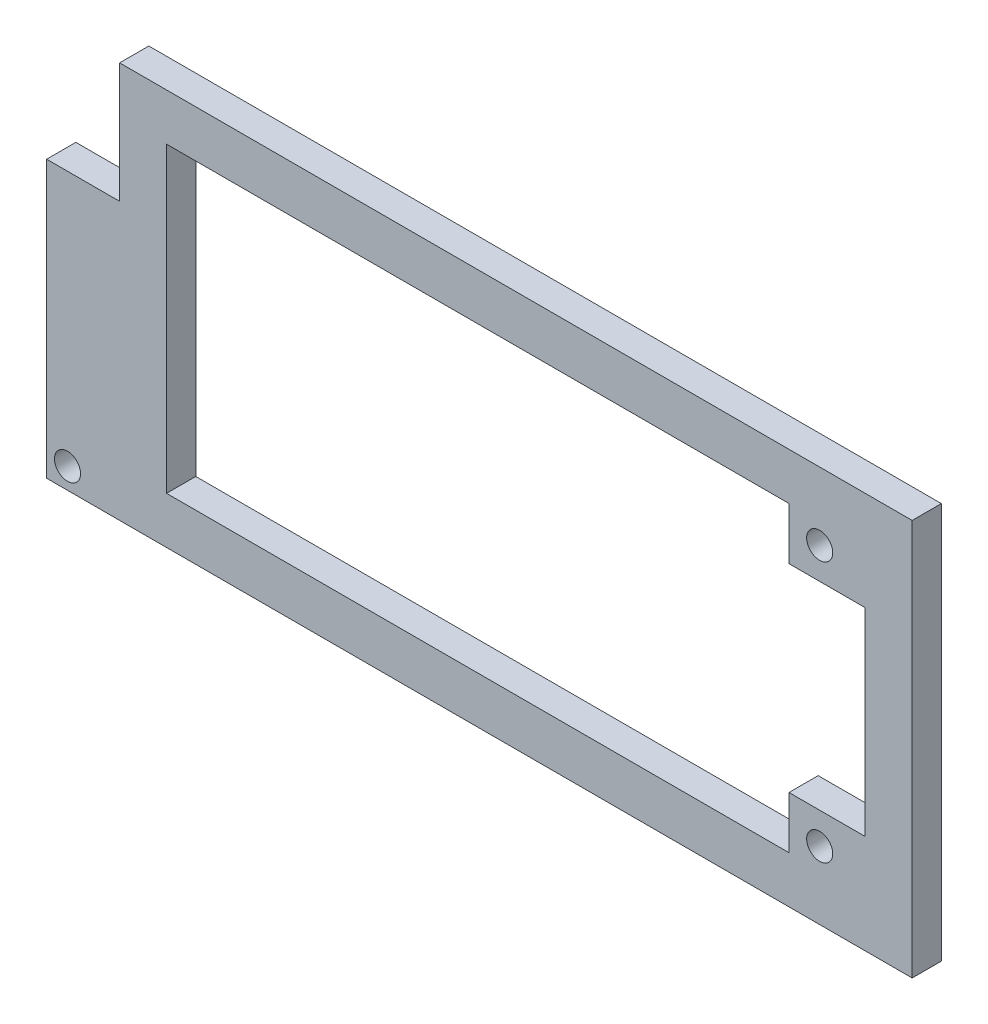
from build123d import *

# Parameters (mm, degrees)
SKETCH1_R      = 1.25
EXTRUDE1_DEPTH = 2.8


with BuildPart() as part:
    # Sketch1 → Extrude1 (new body)
    with BuildSketch(Plane.XY):
        Polygon((0, 0), (0, 26.5), (7, 26.5), (7, 38), (83, 38), (83, 0), align=None)
        with Locations((74.130784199, 6.5)):
            Circle(SKETCH1_R, mode=Mode.SUBTRACT)
        with Locations((74.130784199, 31.5)):
            Circle(SKETCH1_R, mode=Mode.SUBTRACT)
        with Locations((2, 2)):
            Circle(SKETCH1_R, mode=Mode.SUBTRACT)
        Polygon((11.5, 33.5), (11.5, 4.5), (71.186962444, 4.5), (71.186962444, 9.5), (78.5, 9.5), (78.5, 28.5), (71.186962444, 28.5), (71.186962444, 33.5), align=None, mode=Mode.SUBTRACT)
    extrude(amount=EXTRUDE1_DEPTH)


solid = part.part
